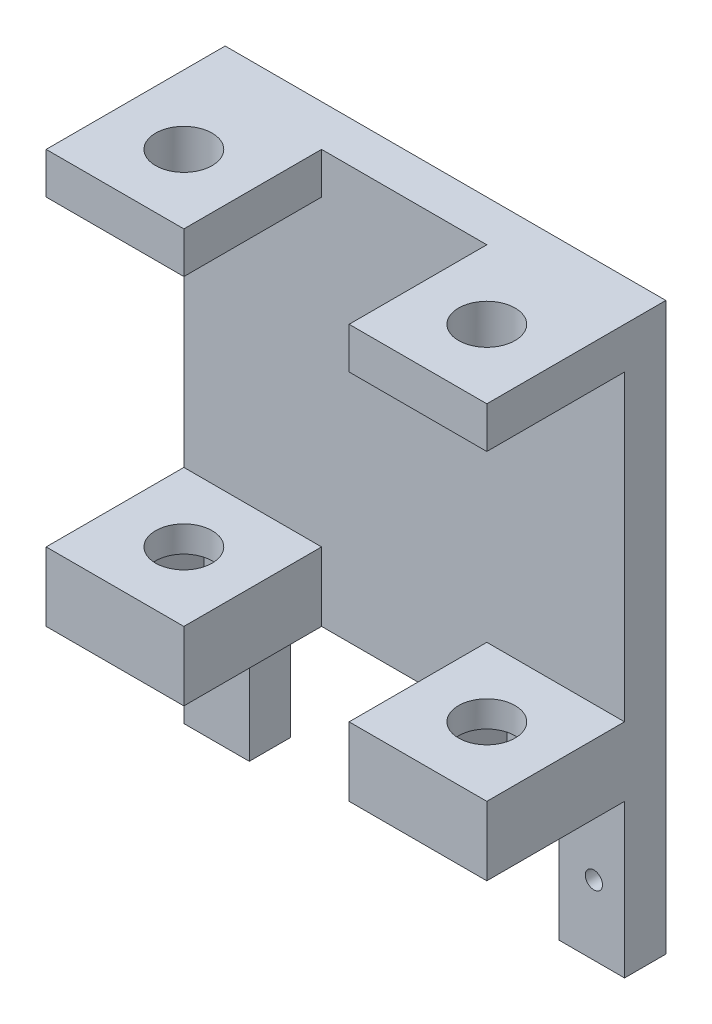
ISO-10303-21;
HEADER;
FILE_DESCRIPTION(('STEP AP214'),'2;1');
FILE_NAME('part.step','',(''),(''),'','','');
FILE_SCHEMA(('AUTOMOTIVE_DESIGN { 1 0 10303 214 1 1 1 1 }'));
ENDSEC;
DATA;
#1=APPLICATION_CONTEXT('core data for automotive mechanical design processes');
#2=APPLICATION_PROTOCOL_DEFINITION('international standard','automotive_design',2000,#1);
#3=PRODUCT_CONTEXT('',#1,'mechanical');
#4=PRODUCT('Part','Part','',(#3));
#5=PRODUCT_RELATED_PRODUCT_CATEGORY('part','',(#4));
#6=PRODUCT_DEFINITION_FORMATION('','',#4);
#7=PRODUCT_DEFINITION_CONTEXT('part definition',#1,'design');
#8=PRODUCT_DEFINITION('design','',#6,#7);
#9=PRODUCT_DEFINITION_SHAPE('','',#8);
#10=(LENGTH_UNIT() NAMED_UNIT(*) SI_UNIT(.MILLI.,.METRE.));
#11=(NAMED_UNIT(*) PLANE_ANGLE_UNIT() SI_UNIT($,.RADIAN.));
#12=(NAMED_UNIT(*) SI_UNIT($,.STERADIAN.) SOLID_ANGLE_UNIT());
#13=UNCERTAINTY_MEASURE_WITH_UNIT(LENGTH_MEASURE(1.E-05),#10,'distance_accuracy_value','');
#14=(GEOMETRIC_REPRESENTATION_CONTEXT(3) GLOBAL_UNCERTAINTY_ASSIGNED_CONTEXT((#13)) GLOBAL_UNIT_ASSIGNED_CONTEXT((#10,
#11,#12)) REPRESENTATION_CONTEXT('',''));
#15=CARTESIAN_POINT('',(0.,0.,0.));
#16=DIRECTION('',(0.,0.,1.));
#17=DIRECTION('',(1.,0.,0.));
#18=AXIS2_PLACEMENT_3D('',#15,#16,#17);
#19=CARTESIAN_POINT('',(-16.,-15.,5.5));
#20=DIRECTION('',(0.,1.,0.));
#21=DIRECTION('',(0.,0.,1.));
#22=AXIS2_PLACEMENT_3D('',#19,#20,#21);
#23=PLANE('',#22);
#24=DIRECTION('',(0.5,0.,0.866025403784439));
#25=VECTOR('',#24,1.);
#26=CARTESIAN_POINT('',(13.0207259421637,-15.,7.));
#27=LINE('',#26,#25);
#28=CARTESIAN_POINT('',(13.0207259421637,-15.,7.));
#29=VERTEX_POINT('',#28);
#30=CARTESIAN_POINT('',(15.0414518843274,-15.,10.5));
#31=VERTEX_POINT('',#30);
#32=EDGE_CURVE('E390',#29,#31,#27,.T.);
#33=ORIENTED_EDGE('',*,*,#32,.F.);
#34=DIRECTION('',(1.,0.,0.));
#35=VECTOR('',#34,1.);
#36=CARTESIAN_POINT('',(8.97927405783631,-15.,7.));
#37=LINE('',#36,#35);
#38=CARTESIAN_POINT('',(8.97927405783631,-15.,7.));
#39=VERTEX_POINT('',#38);
#40=EDGE_CURVE('E318',#39,#29,#37,.T.);
#41=ORIENTED_EDGE('',*,*,#40,.F.);
#42=DIRECTION('',(0.499999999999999,0.,-0.866025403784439));
#43=VECTOR('',#42,1.);
#44=CARTESIAN_POINT('',(6.95854811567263,-15.,10.5));
#45=LINE('',#44,#43);
#46=CARTESIAN_POINT('',(6.95854811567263,-15.,10.5));
#47=VERTEX_POINT('',#46);
#48=EDGE_CURVE('E373',#47,#39,#45,.T.);
#49=ORIENTED_EDGE('',*,*,#48,.F.);
#50=DIRECTION('',(-0.5,0.,-0.866025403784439));
#51=VECTOR('',#50,1.);
#52=CARTESIAN_POINT('',(8.97927405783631,-15.,14.));
#53=LINE('',#52,#51);
#54=CARTESIAN_POINT('',(8.97927405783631,-15.,14.));
#55=VERTEX_POINT('',#54);
#56=EDGE_CURVE('E399',#55,#47,#53,.T.);
#57=ORIENTED_EDGE('',*,*,#56,.F.);
#58=DIRECTION('',(-1.,0.,0.));
#59=VECTOR('',#58,1.);
#60=CARTESIAN_POINT('',(13.0207259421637,-15.,14.));
#61=LINE('',#60,#59);
#62=CARTESIAN_POINT('',(13.0207259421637,-15.,14.));
#63=VERTEX_POINT('',#62);
#64=EDGE_CURVE('E396',#63,#55,#61,.T.);
#65=ORIENTED_EDGE('',*,*,#64,.F.);
#66=DIRECTION('',(-0.5,0.,0.866025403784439));
#67=VECTOR('',#66,1.);
#68=CARTESIAN_POINT('',(15.0414518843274,-15.,10.5));
#69=LINE('',#68,#67);
#70=EDGE_CURVE('E393',#31,#63,#69,.T.);
#71=ORIENTED_EDGE('',*,*,#70,.F.);
#72=EDGE_LOOP('',(#33,#41,#49,#57,#65,#71));
#73=FACE_BOUND('',#72,.T.);
#74=DIRECTION('',(0.5,0.,0.866025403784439));
#75=VECTOR('',#74,1.);
#76=CARTESIAN_POINT('',(-8.9792740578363,-15.,7.));
#77=LINE('',#76,#75);
#78=CARTESIAN_POINT('',(-8.9792740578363,-15.,7.));
#79=VERTEX_POINT('',#78);
#80=CARTESIAN_POINT('',(-6.95854811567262,-15.,10.5));
#81=VERTEX_POINT('',#80);
#82=EDGE_CURVE('E341',#79,#81,#77,.T.);
#83=ORIENTED_EDGE('',*,*,#82,.F.);
#84=DIRECTION('',(1.,0.,0.));
#85=VECTOR('',#84,1.);
#86=CARTESIAN_POINT('',(-13.0207259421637,-15.,7.));
#87=LINE('',#86,#85);
#88=CARTESIAN_POINT('',(-13.0207259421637,-15.,7.));
#89=VERTEX_POINT('',#88);
#90=EDGE_CURVE('E339',#89,#79,#87,.T.);
#91=ORIENTED_EDGE('',*,*,#90,.F.);
#92=DIRECTION('',(0.5,0.,-0.866025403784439));
#93=VECTOR('',#92,1.);
#94=CARTESIAN_POINT('',(-15.0414518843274,-15.,10.5));
#95=LINE('',#94,#93);
#96=CARTESIAN_POINT('',(-15.0414518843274,-15.,10.5));
#97=VERTEX_POINT('',#96);
#98=EDGE_CURVE('E323',#97,#89,#95,.T.);
#99=ORIENTED_EDGE('',*,*,#98,.F.);
#100=DIRECTION('',(-0.5,0.,-0.866025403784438));
#101=VECTOR('',#100,1.);
#102=CARTESIAN_POINT('',(-13.0207259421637,-15.,14.));
#103=LINE('',#102,#101);
#104=CARTESIAN_POINT('',(-13.0207259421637,-15.,14.));
#105=VERTEX_POINT('',#104);
#106=EDGE_CURVE('E351',#105,#97,#103,.T.);
#107=ORIENTED_EDGE('',*,*,#106,.F.);
#108=DIRECTION('',(-1.,0.,0.));
#109=VECTOR('',#108,1.);
#110=CARTESIAN_POINT('',(-8.97927405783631,-15.,14.));
#111=LINE('',#110,#109);
#112=CARTESIAN_POINT('',(-8.97927405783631,-15.,14.));
#113=VERTEX_POINT('',#112);
#114=EDGE_CURVE('E348',#113,#105,#111,.T.);
#115=ORIENTED_EDGE('',*,*,#114,.F.);
#116=DIRECTION('',(-0.5,0.,0.866025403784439));
#117=VECTOR('',#116,1.);
#118=CARTESIAN_POINT('',(-6.95854811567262,-15.,10.5));
#119=LINE('',#118,#117);
#120=EDGE_CURVE('E345',#81,#113,#119,.T.);
#121=ORIENTED_EDGE('',*,*,#120,.F.);
#122=EDGE_LOOP('',(#83,#91,#99,#107,#115,#121));
#123=FACE_BOUND('',#122,.T.);
#124=DIRECTION('',(1.,0.,0.));
#125=VECTOR('',#124,1.);
#126=CARTESIAN_POINT('',(-16.,-15.,2.5));
#127=LINE('',#126,#125);
#128=CARTESIAN_POINT('',(-11.25,-15.,2.5));
#129=VERTEX_POINT('',#128);
#130=CARTESIAN_POINT('',(11.25,-15.,2.5));
#131=VERTEX_POINT('',#130);
#132=EDGE_CURVE('E543',#129,#131,#127,.T.);
#133=ORIENTED_EDGE('',*,*,#132,.T.);
#134=DIRECTION('',(0.,0.,1.));
#135=VECTOR('',#134,1.);
#136=CARTESIAN_POINT('',(11.25,-15.,-9.58282251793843));
#137=LINE('',#136,#135);
#138=CARTESIAN_POINT('',(11.25,-15.,5.5));
#139=VERTEX_POINT('',#138);
#140=EDGE_CURVE('E54',#131,#139,#137,.T.);
#141=ORIENTED_EDGE('',*,*,#140,.T.);
#142=DIRECTION('',(-1.,0.,0.));
#143=VECTOR('',#142,1.);
#144=CARTESIAN_POINT('',(16.,-15.,5.5));
#145=LINE('',#144,#143);
#146=CARTESIAN_POINT('',(16.,-15.,5.5));
#147=VERTEX_POINT('',#146);
#148=EDGE_CURVE('E59',#147,#139,#145,.T.);
#149=ORIENTED_EDGE('',*,*,#148,.F.);
#150=DIRECTION('',(0.,0.,-1.));
#151=VECTOR('',#150,1.);
#152=CARTESIAN_POINT('',(16.,-15.,5.5));
#153=LINE('',#152,#151);
#154=CARTESIAN_POINT('',(16.,-15.,15.5));
#155=VERTEX_POINT('',#154);
#156=EDGE_CURVE('E549',#155,#147,#153,.T.);
#157=ORIENTED_EDGE('',*,*,#156,.F.);
#158=DIRECTION('',(1.,0.,0.));
#159=VECTOR('',#158,1.);
#160=CARTESIAN_POINT('',(0.,-15.,15.5));
#161=LINE('',#160,#159);
#162=CARTESIAN_POINT('',(6.00000000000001,-15.,15.5));
#163=VERTEX_POINT('',#162);
#164=EDGE_CURVE('E461',#163,#155,#161,.T.);
#165=ORIENTED_EDGE('',*,*,#164,.F.);
#166=DIRECTION('',(0.,0.,-1.));
#167=VECTOR('',#166,1.);
#168=CARTESIAN_POINT('',(6.00000000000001,-15.,15.5));
#169=LINE('',#168,#167);
#170=CARTESIAN_POINT('',(6.00000000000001,-15.,5.5));
#171=VERTEX_POINT('',#170);
#172=EDGE_CURVE('E472',#163,#171,#169,.T.);
#173=ORIENTED_EDGE('',*,*,#172,.T.);
#174=DIRECTION('',(1.,0.,0.));
#175=VECTOR('',#174,1.);
#176=CARTESIAN_POINT('',(-16.,-15.,5.5));
#177=LINE('',#176,#175);
#178=CARTESIAN_POINT('',(-5.99999999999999,-15.,5.5));
#179=VERTEX_POINT('',#178);
#180=EDGE_CURVE('E547',#179,#171,#177,.T.);
#181=ORIENTED_EDGE('',*,*,#180,.F.);
#182=DIRECTION('',(0.,0.,-1.));
#183=VECTOR('',#182,1.);
#184=CARTESIAN_POINT('',(-5.99999999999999,-15.,15.5));
#185=LINE('',#184,#183);
#186=CARTESIAN_POINT('',(-5.99999999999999,-15.,15.5));
#187=VERTEX_POINT('',#186);
#188=EDGE_CURVE('E442',#187,#179,#185,.T.);
#189=ORIENTED_EDGE('',*,*,#188,.F.);
#190=DIRECTION('',(1.,0.,0.));
#191=VECTOR('',#190,1.);
#192=CARTESIAN_POINT('',(0.,-15.,15.5));
#193=LINE('',#192,#191);
#194=CARTESIAN_POINT('',(-16.,-15.,15.5));
#195=VERTEX_POINT('',#194);
#196=EDGE_CURVE('E440',#195,#187,#193,.T.);
#197=ORIENTED_EDGE('',*,*,#196,.F.);
#198=DIRECTION('',(0.,0.,-1.));
#199=VECTOR('',#198,1.);
#200=CARTESIAN_POINT('',(-16.,-15.,5.5));
#201=LINE('',#200,#199);
#202=CARTESIAN_POINT('',(-16.,-15.,5.5));
#203=VERTEX_POINT('',#202);
#204=EDGE_CURVE('E558',#195,#203,#201,.T.);
#205=ORIENTED_EDGE('',*,*,#204,.T.);
#206=DIRECTION('',(-1.,0.,0.));
#207=VECTOR('',#206,1.);
#208=CARTESIAN_POINT('',(-16.,-15.,5.5));
#209=LINE('',#208,#207);
#210=CARTESIAN_POINT('',(-11.25,-15.,5.5));
#211=VERTEX_POINT('',#210);
#212=EDGE_CURVE('E307',#211,#203,#209,.T.);
#213=ORIENTED_EDGE('',*,*,#212,.F.);
#214=DIRECTION('',(0.,0.,1.));
#215=VECTOR('',#214,1.);
#216=CARTESIAN_POINT('',(-11.25,-15.,-9.58282251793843));
#217=LINE('',#216,#215);
#218=EDGE_CURVE('E295',#129,#211,#217,.T.);
#219=ORIENTED_EDGE('',*,*,#218,.F.);
#220=EDGE_LOOP('',(#133,#141,#149,#157,#165,#173,#181,#189,#197,#205,#213,#219));
#221=FACE_BOUND('',#220,.T.);
#222=ADVANCED_FACE('F37',(#73,#123,#221),#23,.F.);
#223=CARTESIAN_POINT('',(-11.,-15.,10.5));
#224=DIRECTION('',(0.,1.,0.));
#225=DIRECTION('',(0.,0.,1.));
#226=AXIS2_PLACEMENT_3D('',#223,#224,#225);
#227=CYLINDRICAL_SURFACE('',#226,2.05);
#228=CARTESIAN_POINT('',(-11.,-10.,10.5));
#229=DIRECTION('',(0.,1.,0.));
#230=DIRECTION('',(0.,0.,1.));
#231=AXIS2_PLACEMENT_3D('',#228,#229,#230);
#232=CIRCLE('',#231,2.05);
#233=CARTESIAN_POINT('',(-11.,-10.,12.55));
#234=VERTEX_POINT('',#233);
#235=EDGE_CURVE('E418',#234,#234,#232,.T.);
#236=ORIENTED_EDGE('',*,*,#235,.T.);
#237=EDGE_LOOP('',(#236));
#238=FACE_BOUND('',#237,.T.);
#239=CARTESIAN_POINT('',(-11.,-11.9,10.5));
#240=DIRECTION('',(0.,-1.,0.));
#241=DIRECTION('',(0.,0.,-1.));
#242=AXIS2_PLACEMENT_3D('',#239,#240,#241);
#243=CIRCLE('',#242,2.05);
#244=CARTESIAN_POINT('',(-11.,-11.9,8.45));
#245=VERTEX_POINT('',#244);
#246=EDGE_CURVE('E41',#245,#245,#243,.F.);
#247=ORIENTED_EDGE('',*,*,#246,.F.);
#248=EDGE_LOOP('',(#247));
#249=FACE_BOUND('',#248,.T.);
#250=ADVANCED_FACE('F591',(#238,#249),#227,.F.);
#251=CARTESIAN_POINT('',(11.,-15.,10.5));
#252=DIRECTION('',(0.,1.,0.));
#253=DIRECTION('',(0.,0.,1.));
#254=AXIS2_PLACEMENT_3D('',#251,#252,#253);
#255=CYLINDRICAL_SURFACE('',#254,2.05);
#256=CARTESIAN_POINT('',(11.,-10.,10.5));
#257=DIRECTION('',(0.,1.,0.));
#258=DIRECTION('',(0.,0.,1.));
#259=AXIS2_PLACEMENT_3D('',#256,#257,#258);
#260=CIRCLE('',#259,2.05);
#261=CARTESIAN_POINT('',(11.,-10.,12.55));
#262=VERTEX_POINT('',#261);
#263=EDGE_CURVE('E425',#262,#262,#260,.T.);
#264=ORIENTED_EDGE('',*,*,#263,.T.);
#265=EDGE_LOOP('',(#264));
#266=FACE_BOUND('',#265,.T.);
#267=CARTESIAN_POINT('',(11.,-11.9,10.5));
#268=DIRECTION('',(0.,-1.,0.));
#269=DIRECTION('',(0.,0.,-1.));
#270=AXIS2_PLACEMENT_3D('',#267,#268,#269);
#271=CIRCLE('',#270,2.05);
#272=CARTESIAN_POINT('',(11.,-11.9,8.45));
#273=VERTEX_POINT('',#272);
#274=EDGE_CURVE('E358',#273,#273,#271,.F.);
#275=ORIENTED_EDGE('',*,*,#274,.F.);
#276=EDGE_LOOP('',(#275));
#277=FACE_BOUND('',#276,.T.);
#278=ADVANCED_FACE('F593',(#266,#277),#255,.F.);
#279=CARTESIAN_POINT('',(0.,0.,5.5));
#280=DIRECTION('',(0.,0.,1.));
#281=DIRECTION('',(1.,0.,0.));
#282=AXIS2_PLACEMENT_3D('',#279,#280,#281);
#283=PLANE('',#282);
#284=DIRECTION('',(0.,-1.,0.));
#285=VECTOR('',#284,1.);
#286=CARTESIAN_POINT('',(-6.,0.,5.5));
#287=LINE('',#286,#285);
#288=CARTESIAN_POINT('',(-5.99999999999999,-10.,5.5));
#289=VERTEX_POINT('',#288);
#290=EDGE_CURVE('E429',#289,#179,#287,.T.);
#291=ORIENTED_EDGE('',*,*,#290,.T.);
#292=ORIENTED_EDGE('',*,*,#180,.T.);
#293=DIRECTION('',(0.,-1.,0.));
#294=VECTOR('',#293,1.);
#295=CARTESIAN_POINT('',(6.,0.,5.5));
#296=LINE('',#295,#294);
#297=CARTESIAN_POINT('',(6.00000000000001,-10.,5.5));
#298=VERTEX_POINT('',#297);
#299=EDGE_CURVE('E459',#298,#171,#296,.T.);
#300=ORIENTED_EDGE('',*,*,#299,.F.);
#301=DIRECTION('',(1.,0.,0.));
#302=VECTOR('',#301,1.);
#303=CARTESIAN_POINT('',(0.,-10.,5.5));
#304=LINE('',#303,#302);
#305=CARTESIAN_POINT('',(16.,-10.,5.5));
#306=VERTEX_POINT('',#305);
#307=EDGE_CURVE('E454',#298,#306,#304,.T.);
#308=ORIENTED_EDGE('',*,*,#307,.T.);
#309=DIRECTION('',(0.,1.,0.));
#310=VECTOR('',#309,1.);
#311=CARTESIAN_POINT('',(16.,15.,5.5));
#312=LINE('',#311,#310);
#313=CARTESIAN_POINT('',(16.,12.,5.5));
#314=VERTEX_POINT('',#313);
#315=EDGE_CURVE('E540',#306,#314,#312,.T.);
#316=ORIENTED_EDGE('',*,*,#315,.T.);
#317=DIRECTION('',(1.,0.,0.));
#318=VECTOR('',#317,1.);
#319=CARTESIAN_POINT('',(0.,12.,5.5));
#320=LINE('',#319,#318);
#321=CARTESIAN_POINT('',(6.00000000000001,12.,5.5));
#322=VERTEX_POINT('',#321);
#323=EDGE_CURVE('E483',#322,#314,#320,.T.);
#324=ORIENTED_EDGE('',*,*,#323,.F.);
#325=DIRECTION('',(0.,-1.,0.));
#326=VECTOR('',#325,1.);
#327=CARTESIAN_POINT('',(6.00000000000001,0.,5.5));
#328=LINE('',#327,#326);
#329=CARTESIAN_POINT('',(6.00000000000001,15.,5.5));
#330=VERTEX_POINT('',#329);
#331=EDGE_CURVE('E478',#330,#322,#328,.T.);
#332=ORIENTED_EDGE('',*,*,#331,.F.);
#333=DIRECTION('',(-1.,0.,0.));
#334=VECTOR('',#333,1.);
#335=CARTESIAN_POINT('',(-16.,15.,5.5));
#336=LINE('',#335,#334);
#337=CARTESIAN_POINT('',(-6.,15.,5.5));
#338=VERTEX_POINT('',#337);
#339=EDGE_CURVE('E542',#330,#338,#336,.T.);
#340=ORIENTED_EDGE('',*,*,#339,.T.);
#341=DIRECTION('',(0.,-1.,0.));
#342=VECTOR('',#341,1.);
#343=CARTESIAN_POINT('',(-6.00000000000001,0.,5.5));
#344=LINE('',#343,#342);
#345=CARTESIAN_POINT('',(-6.,12.,5.5));
#346=VERTEX_POINT('',#345);
#347=EDGE_CURVE('E503',#338,#346,#344,.T.);
#348=ORIENTED_EDGE('',*,*,#347,.T.);
#349=DIRECTION('',(1.,0.,0.));
#350=VECTOR('',#349,1.);
#351=CARTESIAN_POINT('',(0.,12.,5.5));
#352=LINE('',#351,#350);
#353=CARTESIAN_POINT('',(-16.,12.,5.5));
#354=VERTEX_POINT('',#353);
#355=EDGE_CURVE('E508',#354,#346,#352,.T.);
#356=ORIENTED_EDGE('',*,*,#355,.F.);
#357=DIRECTION('',(0.,-1.,0.));
#358=VECTOR('',#357,1.);
#359=CARTESIAN_POINT('',(-16.,15.,5.5));
#360=LINE('',#359,#358);
#361=CARTESIAN_POINT('',(-16.,-10.,5.5));
#362=VERTEX_POINT('',#361);
#363=EDGE_CURVE('E545',#354,#362,#360,.T.);
#364=ORIENTED_EDGE('',*,*,#363,.T.);
#365=DIRECTION('',(1.,0.,0.));
#366=VECTOR('',#365,1.);
#367=CARTESIAN_POINT('',(0.,-10.,5.5));
#368=LINE('',#367,#366);
#369=EDGE_CURVE('E434',#362,#289,#368,.T.);
#370=ORIENTED_EDGE('',*,*,#369,.T.);
#371=EDGE_LOOP('',(#291,#292,#300,#308,#316,#324,#332,#340,#348,#356,#364,#370));
#372=FACE_BOUND('',#371,.T.);
#373=ADVANCED_FACE('F601',(#372),#283,.T.);
#374=CARTESIAN_POINT('',(0.,0.,2.5));
#375=DIRECTION('',(0.,0.,-1.));
#376=DIRECTION('',(-1.,0.,0.));
#377=AXIS2_PLACEMENT_3D('',#374,#375,#376);
#378=CYLINDRICAL_SURFACE('',#377,1.15);
#379=CARTESIAN_POINT('',(0.,0.,2.5));
#380=DIRECTION('',(0.,0.,1.));
#381=DIRECTION('',(1.,0.,0.));
#382=AXIS2_PLACEMENT_3D('',#379,#380,#381);
#383=CIRCLE('',#382,1.15);
#384=CARTESIAN_POINT('',(1.15,0.,2.5));
#385=VERTEX_POINT('',#384);
#386=EDGE_CURVE('E567',#385,#385,#383,.T.);
#387=ORIENTED_EDGE('',*,*,#386,.F.);
#388=EDGE_LOOP('',(#387));
#389=FACE_BOUND('',#388,.T.);
#390=CARTESIAN_POINT('',(0.,0.,0.));
#391=DIRECTION('',(0.,0.,1.));
#392=DIRECTION('',(1.,0.,0.));
#393=AXIS2_PLACEMENT_3D('',#390,#391,#392);
#394=CIRCLE('',#393,1.15);
#395=CARTESIAN_POINT('',(1.15,0.,0.));
#396=VERTEX_POINT('',#395);
#397=EDGE_CURVE('E566',#396,#396,#394,.T.);
#398=ORIENTED_EDGE('',*,*,#397,.T.);
#399=EDGE_LOOP('',(#398));
#400=FACE_BOUND('',#399,.T.);
#401=ADVANCED_FACE('F39',(#389,#400),#378,.T.);
#402=CARTESIAN_POINT('',(0.,0.,0.));
#403=DIRECTION('',(0.,0.,1.));
#404=DIRECTION('',(1.,0.,0.));
#405=AXIS2_PLACEMENT_3D('',#402,#403,#404);
#406=PLANE('',#405);
#407=ORIENTED_EDGE('',*,*,#397,.F.);
#408=EDGE_LOOP('',(#407));
#409=FACE_BOUND('',#408,.T.);
#410=ADVANCED_FACE('F937',(#409),#406,.F.);
#411=CARTESIAN_POINT('',(16.,15.,5.5));
#412=DIRECTION('',(-1.,0.,0.));
#413=DIRECTION('',(0.,-1.,0.));
#414=AXIS2_PLACEMENT_3D('',#411,#412,#413);
#415=PLANE('',#414);
#416=DIRECTION('',(0.,1.,0.));
#417=VECTOR('',#416,1.);
#418=CARTESIAN_POINT('',(16.,15.,2.5));
#419=LINE('',#418,#417);
#420=CARTESIAN_POINT('',(16.,-26.11,2.5));
#421=VERTEX_POINT('',#420);
#422=CARTESIAN_POINT('',(16.,15.,2.5));
#423=VERTEX_POINT('',#422);
#424=EDGE_CURVE('E539',#421,#423,#419,.T.);
#425=ORIENTED_EDGE('',*,*,#424,.T.);
#426=DIRECTION('',(0.,0.,-1.));
#427=VECTOR('',#426,1.);
#428=CARTESIAN_POINT('',(16.,15.,5.5));
#429=LINE('',#428,#427);
#430=CARTESIAN_POINT('',(16.,15.,15.5));
#431=VERTEX_POINT('',#430);
#432=EDGE_CURVE('E563',#431,#423,#429,.T.);
#433=ORIENTED_EDGE('',*,*,#432,.F.);
#434=DIRECTION('',(0.,1.,0.));
#435=VECTOR('',#434,1.);
#436=CARTESIAN_POINT('',(16.,0.,15.5));
#437=LINE('',#436,#435);
#438=CARTESIAN_POINT('',(16.,12.,15.5));
#439=VERTEX_POINT('',#438);
#440=EDGE_CURVE('E487',#439,#431,#437,.T.);
#441=ORIENTED_EDGE('',*,*,#440,.F.);
#442=DIRECTION('',(0.,0.,-1.));
#443=VECTOR('',#442,1.);
#444=CARTESIAN_POINT('',(16.,12.,15.5));
#445=LINE('',#444,#443);
#446=EDGE_CURVE('E490',#439,#314,#445,.T.);
#447=ORIENTED_EDGE('',*,*,#446,.T.);
#448=ORIENTED_EDGE('',*,*,#315,.F.);
#449=DIRECTION('',(0.,0.,-1.));
#450=VECTOR('',#449,1.);
#451=CARTESIAN_POINT('',(16.,-10.,15.5));
#452=LINE('',#451,#450);
#453=CARTESIAN_POINT('',(16.,-10.,15.5));
#454=VERTEX_POINT('',#453);
#455=EDGE_CURVE('E466',#454,#306,#452,.T.);
#456=ORIENTED_EDGE('',*,*,#455,.F.);
#457=DIRECTION('',(0.,1.,0.));
#458=VECTOR('',#457,1.);
#459=CARTESIAN_POINT('',(16.,0.,15.5));
#460=LINE('',#459,#458);
#461=EDGE_CURVE('E464',#155,#454,#460,.T.);
#462=ORIENTED_EDGE('',*,*,#461,.F.);
#463=ORIENTED_EDGE('',*,*,#156,.T.);
#464=DIRECTION('',(0.,1.,0.));
#465=VECTOR('',#464,1.);
#466=CARTESIAN_POINT('',(16.,-15.,5.5));
#467=LINE('',#466,#465);
#468=CARTESIAN_POINT('',(16.,-26.11,5.5));
#469=VERTEX_POINT('',#468);
#470=EDGE_CURVE('E668',#469,#147,#467,.T.);
#471=ORIENTED_EDGE('',*,*,#470,.F.);
#472=DIRECTION('',(0.,0.,1.));
#473=VECTOR('',#472,1.);
#474=CARTESIAN_POINT('',(16.,-26.11,-9.58282251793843));
#475=LINE('',#474,#473);
#476=EDGE_CURVE('E268',#421,#469,#475,.T.);
#477=ORIENTED_EDGE('',*,*,#476,.F.);
#478=EDGE_LOOP('',(#425,#433,#441,#447,#448,#456,#462,#463,#471,#477));
#479=FACE_BOUND('',#478,.T.);
#480=ADVANCED_FACE('F661',(#479),#415,.F.);
#481=CARTESIAN_POINT('',(-16.,15.,5.5));
#482=DIRECTION('',(0.,-1.,0.));
#483=DIRECTION('',(1.,0.,0.));
#484=AXIS2_PLACEMENT_3D('',#481,#482,#483);
#485=PLANE('',#484);
#486=CARTESIAN_POINT('',(11.,15.,10.5));
#487=DIRECTION('',(0.,1.,0.));
#488=DIRECTION('',(0.,0.,1.));
#489=AXIS2_PLACEMENT_3D('',#486,#487,#488);
#490=CIRCLE('',#489,2.05);
#491=CARTESIAN_POINT('',(11.,15.,12.55));
#492=VERTEX_POINT('',#491);
#493=EDGE_CURVE('E415',#492,#492,#490,.T.);
#494=ORIENTED_EDGE('',*,*,#493,.F.);
#495=EDGE_LOOP('',(#494));
#496=FACE_BOUND('',#495,.T.);
#497=CARTESIAN_POINT('',(-11.,15.,10.5));
#498=DIRECTION('',(0.,1.,0.));
#499=DIRECTION('',(0.,0.,1.));
#500=AXIS2_PLACEMENT_3D('',#497,#498,#499);
#501=CIRCLE('',#500,2.05);
#502=CARTESIAN_POINT('',(-11.,15.,12.55));
#503=VERTEX_POINT('',#502);
#504=EDGE_CURVE('E419',#503,#503,#501,.T.);
#505=ORIENTED_EDGE('',*,*,#504,.F.);
#506=EDGE_LOOP('',(#505));
#507=FACE_BOUND('',#506,.T.);
#508=DIRECTION('',(-1.,0.,0.));
#509=VECTOR('',#508,1.);
#510=CARTESIAN_POINT('',(-16.,15.,2.5));
#511=LINE('',#510,#509);
#512=CARTESIAN_POINT('',(-16.,15.,2.5));
#513=VERTEX_POINT('',#512);
#514=EDGE_CURVE('E552',#423,#513,#511,.T.);
#515=ORIENTED_EDGE('',*,*,#514,.T.);
#516=DIRECTION('',(0.,0.,-1.));
#517=VECTOR('',#516,1.);
#518=CARTESIAN_POINT('',(-16.,15.,5.5));
#519=LINE('',#518,#517);
#520=CARTESIAN_POINT('',(-16.,15.,15.5));
#521=VERTEX_POINT('',#520);
#522=EDGE_CURVE('E560',#521,#513,#519,.T.);
#523=ORIENTED_EDGE('',*,*,#522,.F.);
#524=DIRECTION('',(-1.,0.,0.));
#525=VECTOR('',#524,1.);
#526=CARTESIAN_POINT('',(0.,15.,15.5));
#527=LINE('',#526,#525);
#528=CARTESIAN_POINT('',(-6.,15.,15.5));
#529=VERTEX_POINT('',#528);
#530=EDGE_CURVE('E507',#529,#521,#527,.T.);
#531=ORIENTED_EDGE('',*,*,#530,.F.);
#532=DIRECTION('',(0.,0.,-1.));
#533=VECTOR('',#532,1.);
#534=CARTESIAN_POINT('',(-6.,15.,15.5));
#535=LINE('',#534,#533);
#536=EDGE_CURVE('E524',#529,#338,#535,.T.);
#537=ORIENTED_EDGE('',*,*,#536,.T.);
#538=ORIENTED_EDGE('',*,*,#339,.F.);
#539=DIRECTION('',(0.,0.,-1.));
#540=VECTOR('',#539,1.);
#541=CARTESIAN_POINT('',(6.00000000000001,15.,15.5));
#542=LINE('',#541,#540);
#543=CARTESIAN_POINT('',(6.00000000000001,15.,15.5));
#544=VERTEX_POINT('',#543);
#545=EDGE_CURVE('E500',#544,#330,#542,.T.);
#546=ORIENTED_EDGE('',*,*,#545,.F.);
#547=DIRECTION('',(-1.,0.,0.));
#548=VECTOR('',#547,1.);
#549=CARTESIAN_POINT('',(0.,15.,15.5));
#550=LINE('',#549,#548);
#551=EDGE_CURVE('E479',#431,#544,#550,.T.);
#552=ORIENTED_EDGE('',*,*,#551,.F.);
#553=ORIENTED_EDGE('',*,*,#432,.T.);
#554=EDGE_LOOP('',(#515,#523,#531,#537,#538,#546,#552,#553));
#555=FACE_BOUND('',#554,.T.);
#556=ADVANCED_FACE('F686',(#496,#507,#555),#485,.F.);
#557=CARTESIAN_POINT('',(-16.,15.,5.5));
#558=DIRECTION('',(1.,0.,0.));
#559=DIRECTION('',(0.,1.,0.));
#560=AXIS2_PLACEMENT_3D('',#557,#558,#559);
#561=PLANE('',#560);
#562=DIRECTION('',(0.,-1.,0.));
#563=VECTOR('',#562,1.);
#564=CARTESIAN_POINT('',(-16.,15.,2.5));
#565=LINE('',#564,#563);
#566=CARTESIAN_POINT('',(-16.,-26.11,2.5));
#567=VERTEX_POINT('',#566);
#568=EDGE_CURVE('E554',#513,#567,#565,.T.);
#569=ORIENTED_EDGE('',*,*,#568,.T.);
#570=DIRECTION('',(0.,0.,1.));
#571=VECTOR('',#570,1.);
#572=CARTESIAN_POINT('',(-16.,-26.11,-9.58282251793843));
#573=LINE('',#572,#571);
#574=CARTESIAN_POINT('',(-16.,-26.11,5.5));
#575=VERTEX_POINT('',#574);
#576=EDGE_CURVE('E310',#567,#575,#573,.T.);
#577=ORIENTED_EDGE('',*,*,#576,.T.);
#578=DIRECTION('',(0.,-1.,0.));
#579=VECTOR('',#578,1.);
#580=CARTESIAN_POINT('',(-16.,-15.,5.5));
#581=LINE('',#580,#579);
#582=EDGE_CURVE('E298',#203,#575,#581,.T.);
#583=ORIENTED_EDGE('',*,*,#582,.F.);
#584=ORIENTED_EDGE('',*,*,#204,.F.);
#585=DIRECTION('',(0.,-1.,0.));
#586=VECTOR('',#585,1.);
#587=CARTESIAN_POINT('',(-16.,0.,15.5));
#588=LINE('',#587,#586);
#589=CARTESIAN_POINT('',(-16.,-10.,15.5));
#590=VERTEX_POINT('',#589);
#591=EDGE_CURVE('E437',#590,#195,#588,.T.);
#592=ORIENTED_EDGE('',*,*,#591,.F.);
#593=DIRECTION('',(0.,0.,-1.));
#594=VECTOR('',#593,1.);
#595=CARTESIAN_POINT('',(-16.,-10.,15.5));
#596=LINE('',#595,#594);
#597=EDGE_CURVE('E448',#590,#362,#596,.T.);
#598=ORIENTED_EDGE('',*,*,#597,.T.);
#599=ORIENTED_EDGE('',*,*,#363,.F.);
#600=DIRECTION('',(0.,0.,-1.));
#601=VECTOR('',#600,1.);
#602=CARTESIAN_POINT('',(-16.,12.,15.5));
#603=LINE('',#602,#601);
#604=CARTESIAN_POINT('',(-16.,12.,15.5));
#605=VERTEX_POINT('',#604);
#606=EDGE_CURVE('E521',#605,#354,#603,.T.);
#607=ORIENTED_EDGE('',*,*,#606,.F.);
#608=DIRECTION('',(0.,-1.,0.));
#609=VECTOR('',#608,1.);
#610=CARTESIAN_POINT('',(-16.,0.,15.5));
#611=LINE('',#610,#609);
#612=EDGE_CURVE('E511',#521,#605,#611,.T.);
#613=ORIENTED_EDGE('',*,*,#612,.F.);
#614=ORIENTED_EDGE('',*,*,#522,.T.);
#615=EDGE_LOOP('',(#569,#577,#583,#584,#592,#598,#599,#607,#613,#614));
#616=FACE_BOUND('',#615,.T.);
#617=ADVANCED_FACE('F637',(#616),#561,.F.);
#618=CARTESIAN_POINT('',(0.,0.,2.5));
#619=DIRECTION('',(0.,0.,1.));
#620=DIRECTION('',(1.,0.,0.));
#621=AXIS2_PLACEMENT_3D('',#618,#619,#620);
#622=PLANE('',#621);
#623=CARTESIAN_POINT('',(2.5,-9.50000000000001,2.5));
#624=DIRECTION('',(0.,0.,1.));
#625=DIRECTION('',(1.,0.,0.));
#626=AXIS2_PLACEMENT_3D('',#623,#624,#625);
#627=CIRCLE('',#626,1.15);
#628=CARTESIAN_POINT('',(3.65,-9.50000000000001,2.5));
#629=VERTEX_POINT('',#628);
#630=EDGE_CURVE('E11',#629,#629,#627,.F.);
#631=ORIENTED_EDGE('',*,*,#630,.F.);
#632=EDGE_LOOP('',(#631));
#633=FACE_BOUND('',#632,.T.);
#634=CARTESIAN_POINT('',(-2.5,-9.50000000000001,2.5));
#635=DIRECTION('',(0.,0.,1.));
#636=DIRECTION('',(1.,0.,0.));
#637=AXIS2_PLACEMENT_3D('',#634,#635,#636);
#638=CIRCLE('',#637,1.15);
#639=CARTESIAN_POINT('',(-1.35,-9.50000000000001,2.5));
#640=VERTEX_POINT('',#639);
#641=EDGE_CURVE('E46',#640,#640,#638,.F.);
#642=ORIENTED_EDGE('',*,*,#641,.F.);
#643=EDGE_LOOP('',(#642));
#644=FACE_BOUND('',#643,.T.);
#645=CARTESIAN_POINT('',(-2.5,9.5,2.5));
#646=DIRECTION('',(0.,0.,1.));
#647=DIRECTION('',(1.,0.,0.));
#648=AXIS2_PLACEMENT_3D('',#645,#646,#647);
#649=CIRCLE('',#648,1.15);
#650=CARTESIAN_POINT('',(-1.35,9.5,2.5));
#651=VERTEX_POINT('',#650);
#652=EDGE_CURVE('E575',#651,#651,#649,.F.);
#653=ORIENTED_EDGE('',*,*,#652,.F.);
#654=EDGE_LOOP('',(#653));
#655=FACE_BOUND('',#654,.T.);
#656=CARTESIAN_POINT('',(2.5,9.5,2.5));
#657=DIRECTION('',(0.,0.,1.));
#658=DIRECTION('',(1.,0.,0.));
#659=AXIS2_PLACEMENT_3D('',#656,#657,#658);
#660=CIRCLE('',#659,1.15);
#661=CARTESIAN_POINT('',(3.65,9.5,2.5));
#662=VERTEX_POINT('',#661);
#663=EDGE_CURVE('E570',#662,#662,#660,.F.);
#664=ORIENTED_EDGE('',*,*,#663,.F.);
#665=EDGE_LOOP('',(#664));
#666=FACE_BOUND('',#665,.T.);
#667=ORIENTED_EDGE('',*,*,#386,.T.);
#668=EDGE_LOOP('',(#667));
#669=FACE_BOUND('',#668,.T.);
#670=ORIENTED_EDGE('',*,*,#424,.F.);
#671=DIRECTION('',(-1.,0.,0.));
#672=VECTOR('',#671,1.);
#673=CARTESIAN_POINT('',(16.,-26.11,2.5));
#674=LINE('',#673,#672);
#675=CARTESIAN_POINT('',(11.25,-26.11,2.5));
#676=VERTEX_POINT('',#675);
#677=EDGE_CURVE('E288',#421,#676,#674,.T.);
#678=ORIENTED_EDGE('',*,*,#677,.T.);
#679=DIRECTION('',(0.,1.,0.));
#680=VECTOR('',#679,1.);
#681=CARTESIAN_POINT('',(11.25,-15.,2.5));
#682=LINE('',#681,#680);
#683=EDGE_CURVE('E264',#676,#131,#682,.T.);
#684=ORIENTED_EDGE('',*,*,#683,.T.);
#685=ORIENTED_EDGE('',*,*,#132,.F.);
#686=DIRECTION('',(0.,-1.,0.));
#687=VECTOR('',#686,1.);
#688=CARTESIAN_POINT('',(-11.25,-15.,2.5));
#689=LINE('',#688,#687);
#690=CARTESIAN_POINT('',(-11.25,-26.11,2.5));
#691=VERTEX_POINT('',#690);
#692=EDGE_CURVE('E293',#129,#691,#689,.T.);
#693=ORIENTED_EDGE('',*,*,#692,.T.);
#694=DIRECTION('',(-1.,0.,0.));
#695=VECTOR('',#694,1.);
#696=CARTESIAN_POINT('',(-16.,-26.11,2.5));
#697=LINE('',#696,#695);
#698=EDGE_CURVE('E289',#691,#567,#697,.T.);
#699=ORIENTED_EDGE('',*,*,#698,.T.);
#700=ORIENTED_EDGE('',*,*,#568,.F.);
#701=ORIENTED_EDGE('',*,*,#514,.F.);
#702=EDGE_LOOP('',(#670,#678,#684,#685,#693,#699,#700,#701));
#703=FACE_BOUND('',#702,.T.);
#704=CARTESIAN_POINT('',(-13.775,-21.055,2.5));
#705=DIRECTION('',(0.,0.,1.));
#706=DIRECTION('',(1.,0.,0.));
#707=AXIS2_PLACEMENT_3D('',#704,#705,#706);
#708=CIRCLE('',#707,0.625000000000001);
#709=CARTESIAN_POINT('',(-13.15,-21.055,2.5));
#710=VERTEX_POINT('',#709);
#711=EDGE_CURVE('E292',#710,#710,#708,.F.);
#712=ORIENTED_EDGE('',*,*,#711,.F.);
#713=EDGE_LOOP('',(#712));
#714=FACE_BOUND('',#713,.T.);
#715=CARTESIAN_POINT('',(13.775,-21.055,2.5));
#716=DIRECTION('',(0.,0.,1.));
#717=DIRECTION('',(1.,0.,0.));
#718=AXIS2_PLACEMENT_3D('',#715,#716,#717);
#719=CIRCLE('',#718,0.625000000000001);
#720=CARTESIAN_POINT('',(14.4,-21.055,2.5));
#721=VERTEX_POINT('',#720);
#722=EDGE_CURVE('E284',#721,#721,#719,.F.);
#723=ORIENTED_EDGE('',*,*,#722,.F.);
#724=EDGE_LOOP('',(#723));
#725=FACE_BOUND('',#724,.T.);
#726=ADVANCED_FACE('F677',(#633,#644,#655,#666,#669,#703,#714,#725),#622,.F.);
#727=CARTESIAN_POINT('',(2.5,9.5,2.5));
#728=DIRECTION('',(0.,0.,-1.));
#729=DIRECTION('',(-1.,0.,0.));
#730=AXIS2_PLACEMENT_3D('',#727,#728,#729);
#731=CYLINDRICAL_SURFACE('',#730,1.15);
#732=ORIENTED_EDGE('',*,*,#663,.T.);
#733=EDGE_LOOP('',(#732));
#734=FACE_BOUND('',#733,.T.);
#735=CARTESIAN_POINT('',(2.5,9.5,0.));
#736=DIRECTION('',(0.,0.,1.));
#737=DIRECTION('',(1.,0.,0.));
#738=AXIS2_PLACEMENT_3D('',#735,#736,#737);
#739=CIRCLE('',#738,1.15);
#740=CARTESIAN_POINT('',(3.65,9.5,0.));
#741=VERTEX_POINT('',#740);
#742=EDGE_CURVE('E536',#741,#741,#739,.T.);
#743=ORIENTED_EDGE('',*,*,#742,.T.);
#744=EDGE_LOOP('',(#743));
#745=FACE_BOUND('',#744,.T.);
#746=ADVANCED_FACE('F919',(#734,#745),#731,.T.);
#747=CARTESIAN_POINT('',(2.5,9.5,0.));
#748=DIRECTION('',(0.,0.,1.));
#749=DIRECTION('',(1.,0.,0.));
#750=AXIS2_PLACEMENT_3D('',#747,#748,#749);
#751=PLANE('',#750);
#752=ORIENTED_EDGE('',*,*,#742,.F.);
#753=EDGE_LOOP('',(#752));
#754=FACE_BOUND('',#753,.T.);
#755=ADVANCED_FACE('F925',(#754),#751,.F.);
#756=CARTESIAN_POINT('',(-2.5,9.5,2.5));
#757=DIRECTION('',(0.,0.,-1.));
#758=DIRECTION('',(-1.,0.,0.));
#759=AXIS2_PLACEMENT_3D('',#756,#757,#758);
#760=CYLINDRICAL_SURFACE('',#759,1.15);
#761=ORIENTED_EDGE('',*,*,#652,.T.);
#762=EDGE_LOOP('',(#761));
#763=FACE_BOUND('',#762,.T.);
#764=CARTESIAN_POINT('',(-2.5,9.5,0.));
#765=DIRECTION('',(0.,0.,1.));
#766=DIRECTION('',(1.,0.,0.));
#767=AXIS2_PLACEMENT_3D('',#764,#765,#766);
#768=CIRCLE('',#767,1.15);
#769=CARTESIAN_POINT('',(-1.35,9.5,0.));
#770=VERTEX_POINT('',#769);
#771=EDGE_CURVE('E533',#770,#770,#768,.T.);
#772=ORIENTED_EDGE('',*,*,#771,.T.);
#773=EDGE_LOOP('',(#772));
#774=FACE_BOUND('',#773,.T.);
#775=ADVANCED_FACE('F1174',(#763,#774),#760,.T.);
#776=CARTESIAN_POINT('',(-2.5,9.5,0.));
#777=DIRECTION('',(0.,0.,1.));
#778=DIRECTION('',(1.,0.,0.));
#779=AXIS2_PLACEMENT_3D('',#776,#777,#778);
#780=PLANE('',#779);
#781=ORIENTED_EDGE('',*,*,#771,.F.);
#782=EDGE_LOOP('',(#781));
#783=FACE_BOUND('',#782,.T.);
#784=ADVANCED_FACE('F1170',(#783),#780,.F.);
#785=CARTESIAN_POINT('',(-2.5,-9.50000000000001,2.5));
#786=DIRECTION('',(0.,0.,-1.));
#787=DIRECTION('',(-1.,0.,0.));
#788=AXIS2_PLACEMENT_3D('',#785,#786,#787);
#789=CYLINDRICAL_SURFACE('',#788,1.15);
#790=ORIENTED_EDGE('',*,*,#641,.T.);
#791=EDGE_LOOP('',(#790));
#792=FACE_BOUND('',#791,.T.);
#793=CARTESIAN_POINT('',(-2.5,-9.50000000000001,0.));
#794=DIRECTION('',(0.,0.,1.));
#795=DIRECTION('',(1.,0.,0.));
#796=AXIS2_PLACEMENT_3D('',#793,#794,#795);
#797=CIRCLE('',#796,1.15);
#798=CARTESIAN_POINT('',(-1.35,-9.50000000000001,0.));
#799=VERTEX_POINT('',#798);
#800=EDGE_CURVE('E530',#799,#799,#797,.T.);
#801=ORIENTED_EDGE('',*,*,#800,.T.);
#802=EDGE_LOOP('',(#801));
#803=FACE_BOUND('',#802,.T.);
#804=ADVANCED_FACE('F1166',(#792,#803),#789,.T.);
#805=CARTESIAN_POINT('',(-2.5,-9.50000000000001,0.));
#806=DIRECTION('',(0.,0.,1.));
#807=DIRECTION('',(1.,0.,0.));
#808=AXIS2_PLACEMENT_3D('',#805,#806,#807);
#809=PLANE('',#808);
#810=ORIENTED_EDGE('',*,*,#800,.F.);
#811=EDGE_LOOP('',(#810));
#812=FACE_BOUND('',#811,.T.);
#813=ADVANCED_FACE('F1162',(#812),#809,.F.);
#814=CARTESIAN_POINT('',(2.5,-9.50000000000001,2.5));
#815=DIRECTION('',(0.,0.,-1.));
#816=DIRECTION('',(-1.,0.,0.));
#817=AXIS2_PLACEMENT_3D('',#814,#815,#816);
#818=CYLINDRICAL_SURFACE('',#817,1.15);
#819=ORIENTED_EDGE('',*,*,#630,.T.);
#820=EDGE_LOOP('',(#819));
#821=FACE_BOUND('',#820,.T.);
#822=CARTESIAN_POINT('',(2.5,-9.50000000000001,0.));
#823=DIRECTION('',(0.,0.,1.));
#824=DIRECTION('',(1.,0.,0.));
#825=AXIS2_PLACEMENT_3D('',#822,#823,#824);
#826=CIRCLE('',#825,1.15);
#827=CARTESIAN_POINT('',(3.65,-9.50000000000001,0.));
#828=VERTEX_POINT('',#827);
#829=EDGE_CURVE('E527',#828,#828,#826,.T.);
#830=ORIENTED_EDGE('',*,*,#829,.T.);
#831=EDGE_LOOP('',(#830));
#832=FACE_BOUND('',#831,.T.);
#833=ADVANCED_FACE('F1158',(#821,#832),#818,.T.);
#834=CARTESIAN_POINT('',(2.5,-9.50000000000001,0.));
#835=DIRECTION('',(0.,0.,1.));
#836=DIRECTION('',(1.,0.,0.));
#837=AXIS2_PLACEMENT_3D('',#834,#835,#836);
#838=PLANE('',#837);
#839=ORIENTED_EDGE('',*,*,#829,.F.);
#840=EDGE_LOOP('',(#839));
#841=FACE_BOUND('',#840,.T.);
#842=ADVANCED_FACE('F1060',(#841),#838,.F.);
#843=CARTESIAN_POINT('',(-6.00000000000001,0.,15.5));
#844=DIRECTION('',(1.,0.,0.));
#845=DIRECTION('',(0.,1.,0.));
#846=AXIS2_PLACEMENT_3D('',#843,#844,#845);
#847=PLANE('',#846);
#848=ORIENTED_EDGE('',*,*,#347,.F.);
#849=ORIENTED_EDGE('',*,*,#536,.F.);
#850=DIRECTION('',(0.,-1.,0.));
#851=VECTOR('',#850,1.);
#852=CARTESIAN_POINT('',(-6.00000000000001,0.,15.5));
#853=LINE('',#852,#851);
#854=CARTESIAN_POINT('',(-6.,12.,15.5));
#855=VERTEX_POINT('',#854);
#856=EDGE_CURVE('E504',#529,#855,#853,.T.);
#857=ORIENTED_EDGE('',*,*,#856,.T.);
#858=DIRECTION('',(0.,0.,-1.));
#859=VECTOR('',#858,1.);
#860=CARTESIAN_POINT('',(-6.,12.,15.5));
#861=LINE('',#860,#859);
#862=EDGE_CURVE('E515',#855,#346,#861,.T.);
#863=ORIENTED_EDGE('',*,*,#862,.T.);
#864=EDGE_LOOP('',(#848,#849,#857,#863));
#865=FACE_BOUND('',#864,.T.);
#866=ADVANCED_FACE('F628',(#865),#847,.T.);
#867=CARTESIAN_POINT('',(0.,12.,15.5));
#868=DIRECTION('',(0.,1.,0.));
#869=DIRECTION('',(-1.,0.,0.));
#870=AXIS2_PLACEMENT_3D('',#867,#868,#869);
#871=PLANE('',#870);
#872=CARTESIAN_POINT('',(-11.,12.,10.5));
#873=DIRECTION('',(0.,1.,0.));
#874=DIRECTION('',(-1.,0.,0.));
#875=AXIS2_PLACEMENT_3D('',#872,#873,#874);
#876=CIRCLE('',#875,2.05);
#877=CARTESIAN_POINT('',(-13.05,12.,10.5));
#878=VERTEX_POINT('',#877);
#879=EDGE_CURVE('E422',#878,#878,#876,.T.);
#880=ORIENTED_EDGE('',*,*,#879,.T.);
#881=EDGE_LOOP('',(#880));
#882=FACE_BOUND('',#881,.T.);
#883=ORIENTED_EDGE('',*,*,#355,.T.);
#884=ORIENTED_EDGE('',*,*,#862,.F.);
#885=DIRECTION('',(1.,0.,0.));
#886=VECTOR('',#885,1.);
#887=CARTESIAN_POINT('',(0.,12.,15.5));
#888=LINE('',#887,#886);
#889=EDGE_CURVE('E513',#605,#855,#888,.T.);
#890=ORIENTED_EDGE('',*,*,#889,.F.);
#891=ORIENTED_EDGE('',*,*,#606,.T.);
#892=EDGE_LOOP('',(#883,#884,#890,#891));
#893=FACE_BOUND('',#892,.T.);
#894=ADVANCED_FACE('F624',(#882,#893),#871,.F.);
#895=CARTESIAN_POINT('',(0.,0.,15.5));
#896=DIRECTION('',(0.,0.,1.));
#897=DIRECTION('',(1.,0.,0.));
#898=AXIS2_PLACEMENT_3D('',#895,#896,#897);
#899=PLANE('',#898);
#900=ORIENTED_EDGE('',*,*,#856,.F.);
#901=ORIENTED_EDGE('',*,*,#530,.T.);
#902=ORIENTED_EDGE('',*,*,#612,.T.);
#903=ORIENTED_EDGE('',*,*,#889,.T.);
#904=EDGE_LOOP('',(#900,#901,#902,#903));
#905=FACE_BOUND('',#904,.T.);
#906=ADVANCED_FACE('F627',(#905),#899,.T.);
#907=CARTESIAN_POINT('',(6.00000000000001,0.,15.5));
#908=DIRECTION('',(1.,0.,0.));
#909=DIRECTION('',(0.,1.,0.));
#910=AXIS2_PLACEMENT_3D('',#907,#908,#909);
#911=PLANE('',#910);
#912=ORIENTED_EDGE('',*,*,#331,.T.);
#913=DIRECTION('',(0.,0.,-1.));
#914=VECTOR('',#913,1.);
#915=CARTESIAN_POINT('',(6.00000000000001,12.,15.5));
#916=LINE('',#915,#914);
#917=CARTESIAN_POINT('',(6.00000000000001,12.,15.5));
#918=VERTEX_POINT('',#917);
#919=EDGE_CURVE('E497',#918,#322,#916,.T.);
#920=ORIENTED_EDGE('',*,*,#919,.F.);
#921=DIRECTION('',(0.,-1.,0.));
#922=VECTOR('',#921,1.);
#923=CARTESIAN_POINT('',(6.00000000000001,0.,15.5));
#924=LINE('',#923,#922);
#925=EDGE_CURVE('E482',#544,#918,#924,.T.);
#926=ORIENTED_EDGE('',*,*,#925,.F.);
#927=ORIENTED_EDGE('',*,*,#545,.T.);
#928=EDGE_LOOP('',(#912,#920,#926,#927));
#929=FACE_BOUND('',#928,.T.);
#930=ADVANCED_FACE('F689',(#929),#911,.F.);
#931=CARTESIAN_POINT('',(0.,12.,15.5));
#932=DIRECTION('',(0.,1.,0.));
#933=DIRECTION('',(-1.,0.,0.));
#934=AXIS2_PLACEMENT_3D('',#931,#932,#933);
#935=PLANE('',#934);
#936=CARTESIAN_POINT('',(11.,12.,10.5));
#937=DIRECTION('',(0.,1.,0.));
#938=DIRECTION('',(-1.,0.,0.));
#939=AXIS2_PLACEMENT_3D('',#936,#937,#938);
#940=CIRCLE('',#939,2.05);
#941=CARTESIAN_POINT('',(8.95,12.,10.5));
#942=VERTEX_POINT('',#941);
#943=EDGE_CURVE('E426',#942,#942,#940,.T.);
#944=ORIENTED_EDGE('',*,*,#943,.T.);
#945=EDGE_LOOP('',(#944));
#946=FACE_BOUND('',#945,.T.);
#947=ORIENTED_EDGE('',*,*,#323,.T.);
#948=ORIENTED_EDGE('',*,*,#446,.F.);
#949=DIRECTION('',(1.,0.,0.));
#950=VECTOR('',#949,1.);
#951=CARTESIAN_POINT('',(0.,12.,15.5));
#952=LINE('',#951,#950);
#953=EDGE_CURVE('E485',#918,#439,#952,.T.);
#954=ORIENTED_EDGE('',*,*,#953,.F.);
#955=ORIENTED_EDGE('',*,*,#919,.T.);
#956=EDGE_LOOP('',(#947,#948,#954,#955));
#957=FACE_BOUND('',#956,.T.);
#958=ADVANCED_FACE('F692',(#946,#957),#935,.F.);
#959=CARTESIAN_POINT('',(0.,0.,15.5));
#960=DIRECTION('',(0.,0.,1.));
#961=DIRECTION('',(1.,0.,0.));
#962=AXIS2_PLACEMENT_3D('',#959,#960,#961);
#963=PLANE('',#962);
#964=ORIENTED_EDGE('',*,*,#551,.T.);
#965=ORIENTED_EDGE('',*,*,#925,.T.);
#966=ORIENTED_EDGE('',*,*,#953,.T.);
#967=ORIENTED_EDGE('',*,*,#440,.T.);
#968=EDGE_LOOP('',(#964,#965,#966,#967));
#969=FACE_BOUND('',#968,.T.);
#970=ADVANCED_FACE('F683',(#969),#963,.T.);
#971=CARTESIAN_POINT('',(0.,-10.,15.5));
#972=DIRECTION('',(0.,1.,0.));
#973=DIRECTION('',(0.,0.,1.));
#974=AXIS2_PLACEMENT_3D('',#971,#972,#973);
#975=PLANE('',#974);
#976=ORIENTED_EDGE('',*,*,#263,.F.);
#977=EDGE_LOOP('',(#976));
#978=FACE_BOUND('',#977,.T.);
#979=ORIENTED_EDGE('',*,*,#307,.F.);
#980=DIRECTION('',(0.,0.,-1.));
#981=VECTOR('',#980,1.);
#982=CARTESIAN_POINT('',(6.00000000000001,-10.,15.5));
#983=LINE('',#982,#981);
#984=CARTESIAN_POINT('',(6.00000000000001,-10.,15.5));
#985=VERTEX_POINT('',#984);
#986=EDGE_CURVE('E475',#985,#298,#983,.T.);
#987=ORIENTED_EDGE('',*,*,#986,.F.);
#988=DIRECTION('',(1.,0.,0.));
#989=VECTOR('',#988,1.);
#990=CARTESIAN_POINT('',(0.,-10.,15.5));
#991=LINE('',#990,#989);
#992=EDGE_CURVE('E455',#985,#454,#991,.T.);
#993=ORIENTED_EDGE('',*,*,#992,.T.);
#994=ORIENTED_EDGE('',*,*,#455,.T.);
#995=EDGE_LOOP('',(#979,#987,#993,#994));
#996=FACE_BOUND('',#995,.T.);
#997=ADVANCED_FACE('F665',(#978,#996),#975,.T.);
#998=CARTESIAN_POINT('',(6.,0.,15.5));
#999=DIRECTION('',(1.,0.,0.));
#1000=DIRECTION('',(0.,1.,0.));
#1001=AXIS2_PLACEMENT_3D('',#998,#999,#1000);
#1002=PLANE('',#1001);
#1003=ORIENTED_EDGE('',*,*,#299,.T.);
#1004=ORIENTED_EDGE('',*,*,#172,.F.);
#1005=DIRECTION('',(0.,-1.,0.));
#1006=VECTOR('',#1005,1.);
#1007=CARTESIAN_POINT('',(6.,0.,15.5));
#1008=LINE('',#1007,#1006);
#1009=EDGE_CURVE('E458',#985,#163,#1008,.T.);
#1010=ORIENTED_EDGE('',*,*,#1009,.F.);
#1011=ORIENTED_EDGE('',*,*,#986,.T.);
#1012=EDGE_LOOP('',(#1003,#1004,#1010,#1011));
#1013=FACE_BOUND('',#1012,.T.);
#1014=ADVANCED_FACE('F654',(#1013),#1002,.F.);
#1015=CARTESIAN_POINT('',(0.,0.,15.5));
#1016=DIRECTION('',(0.,0.,1.));
#1017=DIRECTION('',(1.,0.,0.));
#1018=AXIS2_PLACEMENT_3D('',#1015,#1016,#1017);
#1019=PLANE('',#1018);
#1020=ORIENTED_EDGE('',*,*,#992,.F.);
#1021=ORIENTED_EDGE('',*,*,#1009,.T.);
#1022=ORIENTED_EDGE('',*,*,#164,.T.);
#1023=ORIENTED_EDGE('',*,*,#461,.T.);
#1024=EDGE_LOOP('',(#1020,#1021,#1022,#1023));
#1025=FACE_BOUND('',#1024,.T.);
#1026=ADVANCED_FACE('F667',(#1025),#1019,.T.);
#1027=CARTESIAN_POINT('',(-6.,0.,15.5));
#1028=DIRECTION('',(1.,0.,0.));
#1029=DIRECTION('',(0.,1.,0.));
#1030=AXIS2_PLACEMENT_3D('',#1027,#1028,#1029);
#1031=PLANE('',#1030);
#1032=ORIENTED_EDGE('',*,*,#290,.F.);
#1033=DIRECTION('',(0.,0.,-1.));
#1034=VECTOR('',#1033,1.);
#1035=CARTESIAN_POINT('',(-5.99999999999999,-10.,15.5));
#1036=LINE('',#1035,#1034);
#1037=CARTESIAN_POINT('',(-5.99999999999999,-10.,15.5));
#1038=VERTEX_POINT('',#1037);
#1039=EDGE_CURVE('E451',#1038,#289,#1036,.T.);
#1040=ORIENTED_EDGE('',*,*,#1039,.F.);
#1041=DIRECTION('',(0.,-1.,0.));
#1042=VECTOR('',#1041,1.);
#1043=CARTESIAN_POINT('',(-6.,0.,15.5));
#1044=LINE('',#1043,#1042);
#1045=EDGE_CURVE('E430',#1038,#187,#1044,.T.);
#1046=ORIENTED_EDGE('',*,*,#1045,.T.);
#1047=ORIENTED_EDGE('',*,*,#188,.T.);
#1048=EDGE_LOOP('',(#1032,#1040,#1046,#1047));
#1049=FACE_BOUND('',#1048,.T.);
#1050=ADVANCED_FACE('F647',(#1049),#1031,.T.);
#1051=CARTESIAN_POINT('',(0.,-10.,15.5));
#1052=DIRECTION('',(0.,1.,0.));
#1053=DIRECTION('',(0.,0.,1.));
#1054=AXIS2_PLACEMENT_3D('',#1051,#1052,#1053);
#1055=PLANE('',#1054);
#1056=ORIENTED_EDGE('',*,*,#235,.F.);
#1057=EDGE_LOOP('',(#1056));
#1058=FACE_BOUND('',#1057,.T.);
#1059=ORIENTED_EDGE('',*,*,#369,.F.);
#1060=ORIENTED_EDGE('',*,*,#597,.F.);
#1061=DIRECTION('',(1.,0.,0.));
#1062=VECTOR('',#1061,1.);
#1063=CARTESIAN_POINT('',(0.,-10.,15.5));
#1064=LINE('',#1063,#1062);
#1065=EDGE_CURVE('E433',#590,#1038,#1064,.T.);
#1066=ORIENTED_EDGE('',*,*,#1065,.T.);
#1067=ORIENTED_EDGE('',*,*,#1039,.T.);
#1068=EDGE_LOOP('',(#1059,#1060,#1066,#1067));
#1069=FACE_BOUND('',#1068,.T.);
#1070=ADVANCED_FACE('F643',(#1058,#1069),#1055,.T.);
#1071=CARTESIAN_POINT('',(0.,0.,15.5));
#1072=DIRECTION('',(0.,0.,1.));
#1073=DIRECTION('',(1.,0.,0.));
#1074=AXIS2_PLACEMENT_3D('',#1071,#1072,#1073);
#1075=PLANE('',#1074);
#1076=ORIENTED_EDGE('',*,*,#1045,.F.);
#1077=ORIENTED_EDGE('',*,*,#1065,.F.);
#1078=ORIENTED_EDGE('',*,*,#591,.T.);
#1079=ORIENTED_EDGE('',*,*,#196,.T.);
#1080=EDGE_LOOP('',(#1076,#1077,#1078,#1079));
#1081=FACE_BOUND('',#1080,.T.);
#1082=ADVANCED_FACE('F618',(#1081),#1075,.T.);
#1083=ORIENTED_EDGE('',*,*,#493,.T.);
#1084=EDGE_LOOP('',(#1083));
#1085=FACE_BOUND('',#1084,.T.);
#1086=ORIENTED_EDGE('',*,*,#943,.F.);
#1087=EDGE_LOOP('',(#1086));
#1088=FACE_BOUND('',#1087,.T.);
#1089=ADVANCED_FACE('F604',(#1085,#1088),#255,.F.);
#1090=ORIENTED_EDGE('',*,*,#504,.T.);
#1091=EDGE_LOOP('',(#1090));
#1092=FACE_BOUND('',#1091,.T.);
#1093=ORIENTED_EDGE('',*,*,#879,.F.);
#1094=EDGE_LOOP('',(#1093));
#1095=FACE_BOUND('',#1094,.T.);
#1096=ADVANCED_FACE('F596',(#1092,#1095),#227,.F.);
#1097=CARTESIAN_POINT('',(0.,-11.9,0.));
#1098=DIRECTION('',(0.,-1.,0.));
#1099=DIRECTION('',(0.,0.,-1.));
#1100=AXIS2_PLACEMENT_3D('',#1097,#1098,#1099);
#1101=PLANE('',#1100);
#1102=DIRECTION('',(1.,0.,0.));
#1103=VECTOR('',#1102,1.);
#1104=CARTESIAN_POINT('',(8.97927405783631,-11.9,7.));
#1105=LINE('',#1104,#1103);
#1106=CARTESIAN_POINT('',(8.97927405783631,-11.9,7.));
#1107=VERTEX_POINT('',#1106);
#1108=CARTESIAN_POINT('',(13.0207259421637,-11.9,7.));
#1109=VERTEX_POINT('',#1108);
#1110=EDGE_CURVE('E369',#1107,#1109,#1105,.T.);
#1111=ORIENTED_EDGE('',*,*,#1110,.T.);
#1112=DIRECTION('',(0.5,0.,0.866025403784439));
#1113=VECTOR('',#1112,1.);
#1114=CARTESIAN_POINT('',(13.0207259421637,-11.9,7.));
#1115=LINE('',#1114,#1113);
#1116=CARTESIAN_POINT('',(15.0414518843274,-11.9,10.5));
#1117=VERTEX_POINT('',#1116);
#1118=EDGE_CURVE('E372',#1109,#1117,#1115,.T.);
#1119=ORIENTED_EDGE('',*,*,#1118,.T.);
#1120=DIRECTION('',(-0.5,0.,0.866025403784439));
#1121=VECTOR('',#1120,1.);
#1122=CARTESIAN_POINT('',(15.0414518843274,-11.9,10.5));
#1123=LINE('',#1122,#1121);
#1124=CARTESIAN_POINT('',(13.0207259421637,-11.9,14.));
#1125=VERTEX_POINT('',#1124);
#1126=EDGE_CURVE('E376',#1117,#1125,#1123,.T.);
#1127=ORIENTED_EDGE('',*,*,#1126,.T.);
#1128=DIRECTION('',(-1.,0.,0.));
#1129=VECTOR('',#1128,1.);
#1130=CARTESIAN_POINT('',(13.0207259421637,-11.9,14.));
#1131=LINE('',#1130,#1129);
#1132=CARTESIAN_POINT('',(8.97927405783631,-11.9,14.));
#1133=VERTEX_POINT('',#1132);
#1134=EDGE_CURVE('E379',#1125,#1133,#1131,.T.);
#1135=ORIENTED_EDGE('',*,*,#1134,.T.);
#1136=DIRECTION('',(-0.5,0.,-0.866025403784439));
#1137=VECTOR('',#1136,1.);
#1138=CARTESIAN_POINT('',(8.97927405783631,-11.9,14.));
#1139=LINE('',#1138,#1137);
#1140=CARTESIAN_POINT('',(6.95854811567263,-11.9,10.5));
#1141=VERTEX_POINT('',#1140);
#1142=EDGE_CURVE('E382',#1133,#1141,#1139,.T.);
#1143=ORIENTED_EDGE('',*,*,#1142,.T.);
#1144=DIRECTION('',(0.499999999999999,0.,-0.866025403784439));
#1145=VECTOR('',#1144,1.);
#1146=CARTESIAN_POINT('',(6.95854811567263,-11.9,10.5));
#1147=LINE('',#1146,#1145);
#1148=EDGE_CURVE('E385',#1141,#1107,#1147,.T.);
#1149=ORIENTED_EDGE('',*,*,#1148,.T.);
#1150=EDGE_LOOP('',(#1111,#1119,#1127,#1135,#1143,#1149));
#1151=FACE_BOUND('',#1150,.T.);
#1152=ORIENTED_EDGE('',*,*,#274,.T.);
#1153=EDGE_LOOP('',(#1152));
#1154=FACE_BOUND('',#1153,.T.);
#1155=ADVANCED_FACE('F609',(#1151,#1154),#1101,.T.);
#1156=CARTESIAN_POINT('',(8.97927405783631,-11.9,7.));
#1157=DIRECTION('',(0.,0.,-1.));
#1158=DIRECTION('',(-1.,0.,0.));
#1159=AXIS2_PLACEMENT_3D('',#1156,#1157,#1158);
#1160=PLANE('',#1159);
#1161=ORIENTED_EDGE('',*,*,#40,.T.);
#1162=DIRECTION('',(0.,-1.,0.));
#1163=VECTOR('',#1162,1.);
#1164=CARTESIAN_POINT('',(13.0207259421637,-11.9,7.));
#1165=LINE('',#1164,#1163);
#1166=EDGE_CURVE('E388',#1109,#29,#1165,.T.);
#1167=ORIENTED_EDGE('',*,*,#1166,.F.);
#1168=ORIENTED_EDGE('',*,*,#1110,.F.);
#1169=DIRECTION('',(0.,-1.,0.));
#1170=VECTOR('',#1169,1.);
#1171=CARTESIAN_POINT('',(8.97927405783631,-11.9,7.));
#1172=LINE('',#1171,#1170);
#1173=EDGE_CURVE('E342',#1107,#39,#1172,.T.);
#1174=ORIENTED_EDGE('',*,*,#1173,.T.);
#1175=EDGE_LOOP('',(#1161,#1167,#1168,#1174));
#1176=FACE_BOUND('',#1175,.T.);
#1177=ADVANCED_FACE('F615',(#1176),#1160,.F.);
#1178=CARTESIAN_POINT('',(6.95854811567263,-11.9,10.5));
#1179=DIRECTION('',(-0.866025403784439,0.,-0.5));
#1180=DIRECTION('',(-0.5,0.,0.866025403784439));
#1181=AXIS2_PLACEMENT_3D('',#1178,#1179,#1180);
#1182=PLANE('',#1181);
#1183=ORIENTED_EDGE('',*,*,#48,.T.);
#1184=ORIENTED_EDGE('',*,*,#1173,.F.);
#1185=ORIENTED_EDGE('',*,*,#1148,.F.);
#1186=DIRECTION('',(0.,-1.,0.));
#1187=VECTOR('',#1186,1.);
#1188=CARTESIAN_POINT('',(6.95854811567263,-11.9,10.5));
#1189=LINE('',#1188,#1187);
#1190=EDGE_CURVE('E405',#1141,#47,#1189,.T.);
#1191=ORIENTED_EDGE('',*,*,#1190,.T.);
#1192=EDGE_LOOP('',(#1183,#1184,#1185,#1191));
#1193=FACE_BOUND('',#1192,.T.);
#1194=ADVANCED_FACE('F750',(#1193),#1182,.F.);
#1195=CARTESIAN_POINT('',(8.97927405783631,-11.9,14.));
#1196=DIRECTION('',(-0.866025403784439,0.,0.5));
#1197=DIRECTION('',(0.5,0.,0.866025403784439));
#1198=AXIS2_PLACEMENT_3D('',#1195,#1196,#1197);
#1199=PLANE('',#1198);
#1200=ORIENTED_EDGE('',*,*,#56,.T.);
#1201=ORIENTED_EDGE('',*,*,#1190,.F.);
#1202=ORIENTED_EDGE('',*,*,#1142,.F.);
#1203=DIRECTION('',(0.,-1.,0.));
#1204=VECTOR('',#1203,1.);
#1205=CARTESIAN_POINT('',(8.97927405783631,-11.9,14.));
#1206=LINE('',#1205,#1204);
#1207=EDGE_CURVE('E407',#1133,#55,#1206,.T.);
#1208=ORIENTED_EDGE('',*,*,#1207,.T.);
#1209=EDGE_LOOP('',(#1200,#1201,#1202,#1208));
#1210=FACE_BOUND('',#1209,.T.);
#1211=ADVANCED_FACE('F753',(#1210),#1199,.F.);
#1212=CARTESIAN_POINT('',(13.0207259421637,-11.9,14.));
#1213=DIRECTION('',(0.,0.,1.));
#1214=DIRECTION('',(1.,0.,0.));
#1215=AXIS2_PLACEMENT_3D('',#1212,#1213,#1214);
#1216=PLANE('',#1215);
#1217=ORIENTED_EDGE('',*,*,#64,.T.);
#1218=ORIENTED_EDGE('',*,*,#1207,.F.);
#1219=ORIENTED_EDGE('',*,*,#1134,.F.);
#1220=DIRECTION('',(0.,-1.,0.));
#1221=VECTOR('',#1220,1.);
#1222=CARTESIAN_POINT('',(13.0207259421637,-11.9,14.));
#1223=LINE('',#1222,#1221);
#1224=EDGE_CURVE('E409',#1125,#63,#1223,.T.);
#1225=ORIENTED_EDGE('',*,*,#1224,.T.);
#1226=EDGE_LOOP('',(#1217,#1218,#1219,#1225));
#1227=FACE_BOUND('',#1226,.T.);
#1228=ADVANCED_FACE('F757',(#1227),#1216,.F.);
#1229=CARTESIAN_POINT('',(15.0414518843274,-11.9,10.5));
#1230=DIRECTION('',(0.866025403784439,0.,0.5));
#1231=DIRECTION('',(0.5,0.,-0.866025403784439));
#1232=AXIS2_PLACEMENT_3D('',#1229,#1230,#1231);
#1233=PLANE('',#1232);
#1234=ORIENTED_EDGE('',*,*,#70,.T.);
#1235=ORIENTED_EDGE('',*,*,#1224,.F.);
#1236=ORIENTED_EDGE('',*,*,#1126,.F.);
#1237=DIRECTION('',(0.,-1.,0.));
#1238=VECTOR('',#1237,1.);
#1239=CARTESIAN_POINT('',(15.0414518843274,-11.9,10.5));
#1240=LINE('',#1239,#1238);
#1241=EDGE_CURVE('E411',#1117,#31,#1240,.T.);
#1242=ORIENTED_EDGE('',*,*,#1241,.T.);
#1243=EDGE_LOOP('',(#1234,#1235,#1236,#1242));
#1244=FACE_BOUND('',#1243,.T.);
#1245=ADVANCED_FACE('F761',(#1244),#1233,.F.);
#1246=CARTESIAN_POINT('',(13.0207259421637,-11.9,7.));
#1247=DIRECTION('',(0.866025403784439,0.,-0.5));
#1248=DIRECTION('',(-0.5,0.,-0.866025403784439));
#1249=AXIS2_PLACEMENT_3D('',#1246,#1247,#1248);
#1250=PLANE('',#1249);
#1251=ORIENTED_EDGE('',*,*,#32,.T.);
#1252=ORIENTED_EDGE('',*,*,#1241,.F.);
#1253=ORIENTED_EDGE('',*,*,#1118,.F.);
#1254=ORIENTED_EDGE('',*,*,#1166,.T.);
#1255=EDGE_LOOP('',(#1251,#1252,#1253,#1254));
#1256=FACE_BOUND('',#1255,.T.);
#1257=ADVANCED_FACE('F726',(#1256),#1250,.F.);
#1258=CARTESIAN_POINT('',(0.,-11.9,0.));
#1259=DIRECTION('',(0.,-1.,0.));
#1260=DIRECTION('',(0.,0.,-1.));
#1261=AXIS2_PLACEMENT_3D('',#1258,#1259,#1260);
#1262=PLANE('',#1261);
#1263=DIRECTION('',(1.,0.,0.));
#1264=VECTOR('',#1263,1.);
#1265=CARTESIAN_POINT('',(-13.0207259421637,-11.9,7.));
#1266=LINE('',#1265,#1264);
#1267=CARTESIAN_POINT('',(-13.0207259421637,-11.9,7.));
#1268=VERTEX_POINT('',#1267);
#1269=CARTESIAN_POINT('',(-8.9792740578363,-11.9,7.));
#1270=VERTEX_POINT('',#1269);
#1271=EDGE_CURVE('E319',#1268,#1270,#1266,.T.);
#1272=ORIENTED_EDGE('',*,*,#1271,.T.);
#1273=DIRECTION('',(0.5,0.,0.866025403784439));
#1274=VECTOR('',#1273,1.);
#1275=CARTESIAN_POINT('',(-8.9792740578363,-11.9,7.));
#1276=LINE('',#1275,#1274);
#1277=CARTESIAN_POINT('',(-6.95854811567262,-11.9,10.5));
#1278=VERTEX_POINT('',#1277);
#1279=EDGE_CURVE('E322',#1270,#1278,#1276,.T.);
#1280=ORIENTED_EDGE('',*,*,#1279,.T.);
#1281=DIRECTION('',(-0.5,0.,0.866025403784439));
#1282=VECTOR('',#1281,1.);
#1283=CARTESIAN_POINT('',(-6.95854811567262,-11.9,10.5));
#1284=LINE('',#1283,#1282);
#1285=CARTESIAN_POINT('',(-8.97927405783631,-11.9,14.));
#1286=VERTEX_POINT('',#1285);
#1287=EDGE_CURVE('E326',#1278,#1286,#1284,.T.);
#1288=ORIENTED_EDGE('',*,*,#1287,.T.);
#1289=DIRECTION('',(-1.,0.,0.));
#1290=VECTOR('',#1289,1.);
#1291=CARTESIAN_POINT('',(-8.97927405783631,-11.9,14.));
#1292=LINE('',#1291,#1290);
#1293=CARTESIAN_POINT('',(-13.0207259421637,-11.9,14.));
#1294=VERTEX_POINT('',#1293);
#1295=EDGE_CURVE('E329',#1286,#1294,#1292,.T.);
#1296=ORIENTED_EDGE('',*,*,#1295,.T.);
#1297=DIRECTION('',(-0.5,0.,-0.866025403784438));
#1298=VECTOR('',#1297,1.);
#1299=CARTESIAN_POINT('',(-13.0207259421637,-11.9,14.));
#1300=LINE('',#1299,#1298);
#1301=CARTESIAN_POINT('',(-15.0414518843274,-11.9,10.5));
#1302=VERTEX_POINT('',#1301);
#1303=EDGE_CURVE('E332',#1294,#1302,#1300,.T.);
#1304=ORIENTED_EDGE('',*,*,#1303,.T.);
#1305=DIRECTION('',(0.5,0.,-0.866025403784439));
#1306=VECTOR('',#1305,1.);
#1307=CARTESIAN_POINT('',(-15.0414518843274,-11.9,10.5));
#1308=LINE('',#1307,#1306);
#1309=EDGE_CURVE('E335',#1302,#1268,#1308,.T.);
#1310=ORIENTED_EDGE('',*,*,#1309,.T.);
#1311=EDGE_LOOP('',(#1272,#1280,#1288,#1296,#1304,#1310));
#1312=FACE_BOUND('',#1311,.T.);
#1313=ORIENTED_EDGE('',*,*,#246,.T.);
#1314=EDGE_LOOP('',(#1313));
#1315=FACE_BOUND('',#1314,.T.);
#1316=ADVANCED_FACE('F589',(#1312,#1315),#1262,.T.);
#1317=CARTESIAN_POINT('',(-13.0207259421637,-11.9,7.));
#1318=DIRECTION('',(0.,0.,-1.));
#1319=DIRECTION('',(-1.,0.,0.));
#1320=AXIS2_PLACEMENT_3D('',#1317,#1318,#1319);
#1321=PLANE('',#1320);
#1322=ORIENTED_EDGE('',*,*,#90,.T.);
#1323=DIRECTION('',(0.,-1.,0.));
#1324=VECTOR('',#1323,1.);
#1325=CARTESIAN_POINT('',(-8.9792740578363,-11.9,7.));
#1326=LINE('',#1325,#1324);
#1327=EDGE_CURVE('E338',#1270,#79,#1326,.T.);
#1328=ORIENTED_EDGE('',*,*,#1327,.F.);
#1329=ORIENTED_EDGE('',*,*,#1271,.F.);
#1330=DIRECTION('',(0.,-1.,0.));
#1331=VECTOR('',#1330,1.);
#1332=CARTESIAN_POINT('',(-13.0207259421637,-11.9,7.));
#1333=LINE('',#1332,#1331);
#1334=EDGE_CURVE('E356',#1268,#89,#1333,.T.);
#1335=ORIENTED_EDGE('',*,*,#1334,.T.);
#1336=EDGE_LOOP('',(#1322,#1328,#1329,#1335));
#1337=FACE_BOUND('',#1336,.T.);
#1338=ADVANCED_FACE('F725',(#1337),#1321,.F.);
#1339=CARTESIAN_POINT('',(-15.0414518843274,-11.9,10.5));
#1340=DIRECTION('',(-0.866025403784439,0.,-0.5));
#1341=DIRECTION('',(-0.5,0.,0.866025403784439));
#1342=AXIS2_PLACEMENT_3D('',#1339,#1340,#1341);
#1343=PLANE('',#1342);
#1344=ORIENTED_EDGE('',*,*,#98,.T.);
#1345=ORIENTED_EDGE('',*,*,#1334,.F.);
#1346=ORIENTED_EDGE('',*,*,#1309,.F.);
#1347=DIRECTION('',(0.,-1.,0.));
#1348=VECTOR('',#1347,1.);
#1349=CARTESIAN_POINT('',(-15.0414518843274,-11.9,10.5));
#1350=LINE('',#1349,#1348);
#1351=EDGE_CURVE('E359',#1302,#97,#1350,.T.);
#1352=ORIENTED_EDGE('',*,*,#1351,.T.);
#1353=EDGE_LOOP('',(#1344,#1345,#1346,#1352));
#1354=FACE_BOUND('',#1353,.T.);
#1355=ADVANCED_FACE('F728',(#1354),#1343,.F.);
#1356=CARTESIAN_POINT('',(-13.0207259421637,-11.9,14.));
#1357=DIRECTION('',(-0.866025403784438,0.,0.5));
#1358=DIRECTION('',(0.5,0.,0.866025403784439));
#1359=AXIS2_PLACEMENT_3D('',#1356,#1357,#1358);
#1360=PLANE('',#1359);
#1361=ORIENTED_EDGE('',*,*,#106,.T.);
#1362=ORIENTED_EDGE('',*,*,#1351,.F.);
#1363=ORIENTED_EDGE('',*,*,#1303,.F.);
#1364=DIRECTION('',(0.,-1.,0.));
#1365=VECTOR('',#1364,1.);
#1366=CARTESIAN_POINT('',(-13.0207259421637,-11.9,14.));
#1367=LINE('',#1366,#1365);
#1368=EDGE_CURVE('E361',#1294,#105,#1367,.T.);
#1369=ORIENTED_EDGE('',*,*,#1368,.T.);
#1370=EDGE_LOOP('',(#1361,#1362,#1363,#1369));
#1371=FACE_BOUND('',#1370,.T.);
#1372=ADVANCED_FACE('F731',(#1371),#1360,.F.);
#1373=CARTESIAN_POINT('',(-8.97927405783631,-11.9,14.));
#1374=DIRECTION('',(0.,0.,1.));
#1375=DIRECTION('',(1.,0.,0.));
#1376=AXIS2_PLACEMENT_3D('',#1373,#1374,#1375);
#1377=PLANE('',#1376);
#1378=ORIENTED_EDGE('',*,*,#114,.T.);
#1379=ORIENTED_EDGE('',*,*,#1368,.F.);
#1380=ORIENTED_EDGE('',*,*,#1295,.F.);
#1381=DIRECTION('',(0.,-1.,0.));
#1382=VECTOR('',#1381,1.);
#1383=CARTESIAN_POINT('',(-8.97927405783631,-11.9,14.));
#1384=LINE('',#1383,#1382);
#1385=EDGE_CURVE('E363',#1286,#113,#1384,.T.);
#1386=ORIENTED_EDGE('',*,*,#1385,.T.);
#1387=EDGE_LOOP('',(#1378,#1379,#1380,#1386));
#1388=FACE_BOUND('',#1387,.T.);
#1389=ADVANCED_FACE('F735',(#1388),#1377,.F.);
#1390=CARTESIAN_POINT('',(-6.95854811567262,-11.9,10.5));
#1391=DIRECTION('',(0.866025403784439,0.,0.5));
#1392=DIRECTION('',(0.5,0.,-0.866025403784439));
#1393=AXIS2_PLACEMENT_3D('',#1390,#1391,#1392);
#1394=PLANE('',#1393);
#1395=ORIENTED_EDGE('',*,*,#120,.T.);
#1396=ORIENTED_EDGE('',*,*,#1385,.F.);
#1397=ORIENTED_EDGE('',*,*,#1287,.F.);
#1398=DIRECTION('',(0.,-1.,0.));
#1399=VECTOR('',#1398,1.);
#1400=CARTESIAN_POINT('',(-6.95854811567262,-11.9,10.5));
#1401=LINE('',#1400,#1399);
#1402=EDGE_CURVE('E365',#1278,#81,#1401,.T.);
#1403=ORIENTED_EDGE('',*,*,#1402,.T.);
#1404=EDGE_LOOP('',(#1395,#1396,#1397,#1403));
#1405=FACE_BOUND('',#1404,.T.);
#1406=ADVANCED_FACE('F739',(#1405),#1394,.F.);
#1407=CARTESIAN_POINT('',(-8.9792740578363,-11.9,7.));
#1408=DIRECTION('',(0.866025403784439,0.,-0.5));
#1409=DIRECTION('',(-0.5,0.,-0.866025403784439));
#1410=AXIS2_PLACEMENT_3D('',#1407,#1408,#1409);
#1411=PLANE('',#1410);
#1412=ORIENTED_EDGE('',*,*,#82,.T.);
#1413=ORIENTED_EDGE('',*,*,#1402,.F.);
#1414=ORIENTED_EDGE('',*,*,#1279,.F.);
#1415=ORIENTED_EDGE('',*,*,#1327,.T.);
#1416=EDGE_LOOP('',(#1412,#1413,#1414,#1415));
#1417=FACE_BOUND('',#1416,.T.);
#1418=ADVANCED_FACE('F719',(#1417),#1411,.F.);
#1419=CARTESIAN_POINT('',(-16.,-26.11,-9.58282251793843));
#1420=DIRECTION('',(0.,-1.,0.));
#1421=DIRECTION('',(0.,0.,-1.));
#1422=AXIS2_PLACEMENT_3D('',#1419,#1420,#1421);
#1423=PLANE('',#1422);
#1424=ORIENTED_EDGE('',*,*,#698,.F.);
#1425=DIRECTION('',(0.,0.,1.));
#1426=VECTOR('',#1425,1.);
#1427=CARTESIAN_POINT('',(-11.25,-26.11,-9.58282251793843));
#1428=LINE('',#1427,#1426);
#1429=CARTESIAN_POINT('',(-11.25,-26.11,5.5));
#1430=VERTEX_POINT('',#1429);
#1431=EDGE_CURVE('E313',#691,#1430,#1428,.T.);
#1432=ORIENTED_EDGE('',*,*,#1431,.T.);
#1433=DIRECTION('',(1.,0.,0.));
#1434=VECTOR('',#1433,1.);
#1435=CARTESIAN_POINT('',(-16.,-26.11,5.5));
#1436=LINE('',#1435,#1434);
#1437=EDGE_CURVE('E301',#575,#1430,#1436,.T.);
#1438=ORIENTED_EDGE('',*,*,#1437,.F.);
#1439=ORIENTED_EDGE('',*,*,#576,.F.);
#1440=EDGE_LOOP('',(#1424,#1432,#1438,#1439));
#1441=FACE_BOUND('',#1440,.T.);
#1442=ADVANCED_FACE('F703',(#1441),#1423,.T.);
#1443=CARTESIAN_POINT('',(-11.25,-15.,-9.58282251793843));
#1444=DIRECTION('',(1.,0.,0.));
#1445=DIRECTION('',(0.,1.,0.));
#1446=AXIS2_PLACEMENT_3D('',#1443,#1444,#1445);
#1447=PLANE('',#1446);
#1448=ORIENTED_EDGE('',*,*,#692,.F.);
#1449=ORIENTED_EDGE('',*,*,#218,.T.);
#1450=DIRECTION('',(0.,1.,0.));
#1451=VECTOR('',#1450,1.);
#1452=CARTESIAN_POINT('',(-11.25,-15.,5.5));
#1453=LINE('',#1452,#1451);
#1454=EDGE_CURVE('E304',#1430,#211,#1453,.T.);
#1455=ORIENTED_EDGE('',*,*,#1454,.F.);
#1456=ORIENTED_EDGE('',*,*,#1431,.F.);
#1457=EDGE_LOOP('',(#1448,#1449,#1455,#1456));
#1458=FACE_BOUND('',#1457,.T.);
#1459=ADVANCED_FACE('F709',(#1458),#1447,.T.);
#1460=CARTESIAN_POINT('',(0.,0.,5.5));
#1461=DIRECTION('',(0.,0.,1.));
#1462=DIRECTION('',(1.,0.,0.));
#1463=AXIS2_PLACEMENT_3D('',#1460,#1461,#1462);
#1464=PLANE('',#1463);
#1465=CARTESIAN_POINT('',(-13.775,-21.055,5.5));
#1466=DIRECTION('',(0.,0.,1.));
#1467=DIRECTION('',(1.,0.,0.));
#1468=AXIS2_PLACEMENT_3D('',#1465,#1466,#1467);
#1469=CIRCLE('',#1468,0.625000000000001);
#1470=CARTESIAN_POINT('',(-13.15,-21.055,5.5));
#1471=VERTEX_POINT('',#1470);
#1472=EDGE_CURVE('E287',#1471,#1471,#1469,.T.);
#1473=ORIENTED_EDGE('',*,*,#1472,.F.);
#1474=EDGE_LOOP('',(#1473));
#1475=FACE_BOUND('',#1474,.T.);
#1476=ORIENTED_EDGE('',*,*,#582,.T.);
#1477=ORIENTED_EDGE('',*,*,#1437,.T.);
#1478=ORIENTED_EDGE('',*,*,#1454,.T.);
#1479=ORIENTED_EDGE('',*,*,#212,.T.);
#1480=EDGE_LOOP('',(#1476,#1477,#1478,#1479));
#1481=FACE_BOUND('',#1480,.T.);
#1482=ADVANCED_FACE('F706',(#1475,#1481),#1464,.T.);
#1483=CARTESIAN_POINT('',(-13.775,-21.055,-9.58282251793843));
#1484=DIRECTION('',(0.,0.,1.));
#1485=DIRECTION('',(1.,0.,0.));
#1486=AXIS2_PLACEMENT_3D('',#1483,#1484,#1485);
#1487=CYLINDRICAL_SURFACE('',#1486,0.625000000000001);
#1488=ORIENTED_EDGE('',*,*,#711,.T.);
#1489=EDGE_LOOP('',(#1488));
#1490=FACE_BOUND('',#1489,.T.);
#1491=ORIENTED_EDGE('',*,*,#1472,.T.);
#1492=EDGE_LOOP('',(#1491));
#1493=FACE_BOUND('',#1492,.T.);
#1494=ADVANCED_FACE('F716',(#1490,#1493),#1487,.F.);
#1495=CARTESIAN_POINT('',(11.25,-15.,-9.58282251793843));
#1496=DIRECTION('',(-1.,0.,0.));
#1497=DIRECTION('',(0.,0.,1.));
#1498=AXIS2_PLACEMENT_3D('',#1495,#1496,#1497);
#1499=PLANE('',#1498);
#1500=ORIENTED_EDGE('',*,*,#683,.F.);
#1501=DIRECTION('',(0.,0.,1.));
#1502=VECTOR('',#1501,1.);
#1503=CARTESIAN_POINT('',(11.25,-26.11,-9.58282251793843));
#1504=LINE('',#1503,#1502);
#1505=CARTESIAN_POINT('',(11.25,-26.11,5.5));
#1506=VERTEX_POINT('',#1505);
#1507=EDGE_CURVE('E259',#676,#1506,#1504,.T.);
#1508=ORIENTED_EDGE('',*,*,#1507,.T.);
#1509=DIRECTION('',(0.,-1.,0.));
#1510=VECTOR('',#1509,1.);
#1511=CARTESIAN_POINT('',(11.25,-15.,5.5));
#1512=LINE('',#1511,#1510);
#1513=EDGE_CURVE('E262',#139,#1506,#1512,.T.);
#1514=ORIENTED_EDGE('',*,*,#1513,.F.);
#1515=ORIENTED_EDGE('',*,*,#140,.F.);
#1516=EDGE_LOOP('',(#1500,#1508,#1514,#1515));
#1517=FACE_BOUND('',#1516,.T.);
#1518=ADVANCED_FACE('F261',(#1517),#1499,.T.);
#1519=CARTESIAN_POINT('',(16.,-26.11,-9.58282251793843));
#1520=DIRECTION('',(0.,-1.,0.));
#1521=DIRECTION('',(0.,0.,-1.));
#1522=AXIS2_PLACEMENT_3D('',#1519,#1520,#1521);
#1523=PLANE('',#1522);
#1524=ORIENTED_EDGE('',*,*,#677,.F.);
#1525=ORIENTED_EDGE('',*,*,#476,.T.);
#1526=DIRECTION('',(1.,0.,0.));
#1527=VECTOR('',#1526,1.);
#1528=CARTESIAN_POINT('',(16.,-26.11,5.5));
#1529=LINE('',#1528,#1527);
#1530=EDGE_CURVE('E274',#1506,#469,#1529,.T.);
#1531=ORIENTED_EDGE('',*,*,#1530,.F.);
#1532=ORIENTED_EDGE('',*,*,#1507,.F.);
#1533=EDGE_LOOP('',(#1524,#1525,#1531,#1532));
#1534=FACE_BOUND('',#1533,.T.);
#1535=ADVANCED_FACE('F276',(#1534),#1523,.T.);
#1536=CARTESIAN_POINT('',(0.,0.,5.5));
#1537=DIRECTION('',(0.,0.,-1.));
#1538=DIRECTION('',(-1.,0.,0.));
#1539=AXIS2_PLACEMENT_3D('',#1536,#1537,#1538);
#1540=PLANE('',#1539);
#1541=CARTESIAN_POINT('',(13.775,-21.055,5.5));
#1542=DIRECTION('',(0.,0.,1.));
#1543=DIRECTION('',(1.,0.,0.));
#1544=AXIS2_PLACEMENT_3D('',#1541,#1542,#1543);
#1545=CIRCLE('',#1544,0.625000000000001);
#1546=CARTESIAN_POINT('',(14.4,-21.055,5.5));
#1547=VERTEX_POINT('',#1546);
#1548=EDGE_CURVE('E669',#1547,#1547,#1545,.T.);
#1549=ORIENTED_EDGE('',*,*,#1548,.F.);
#1550=EDGE_LOOP('',(#1549));
#1551=FACE_BOUND('',#1550,.T.);
#1552=ORIENTED_EDGE('',*,*,#470,.T.);
#1553=ORIENTED_EDGE('',*,*,#148,.T.);
#1554=ORIENTED_EDGE('',*,*,#1513,.T.);
#1555=ORIENTED_EDGE('',*,*,#1530,.T.);
#1556=EDGE_LOOP('',(#1552,#1553,#1554,#1555));
#1557=FACE_BOUND('',#1556,.T.);
#1558=ADVANCED_FACE('F273',(#1551,#1557),#1540,.F.);
#1559=CARTESIAN_POINT('',(13.775,-21.055,-9.58282251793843));
#1560=DIRECTION('',(0.,0.,1.));
#1561=DIRECTION('',(1.,0.,0.));
#1562=AXIS2_PLACEMENT_3D('',#1559,#1560,#1561);
#1563=CYLINDRICAL_SURFACE('',#1562,0.625000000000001);
#1564=ORIENTED_EDGE('',*,*,#722,.T.);
#1565=EDGE_LOOP('',(#1564));
#1566=FACE_BOUND('',#1565,.T.);
#1567=ORIENTED_EDGE('',*,*,#1548,.T.);
#1568=EDGE_LOOP('',(#1567));
#1569=FACE_BOUND('',#1568,.T.);
#1570=ADVANCED_FACE('F901',(#1566,#1569),#1563,.F.);
#1571=CLOSED_SHELL('',(#222,#250,#278,#373,#401,#410,#480,#556,#617,#726,#746,#755,#775,#784,
#804,#813,#833,#842,#866,#894,#906,#930,#958,#970,#997,#1014,#1026,#1050,#1070,#1082,#1089,
#1096,#1155,#1177,#1194,#1211,#1228,#1245,#1257,#1316,#1338,#1355,#1372,#1389,#1406,#1418,#1442,
#1459,#1482,#1494,#1518,#1535,#1558,#1570));
#1572=MANIFOLD_SOLID_BREP('B2',#1571);
#1573=ADVANCED_BREP_SHAPE_REPRESENTATION('',(#18,#1572),#14);
#1574=SHAPE_DEFINITION_REPRESENTATION(#9,#1573);
ENDSEC;
END-ISO-10303-21;
